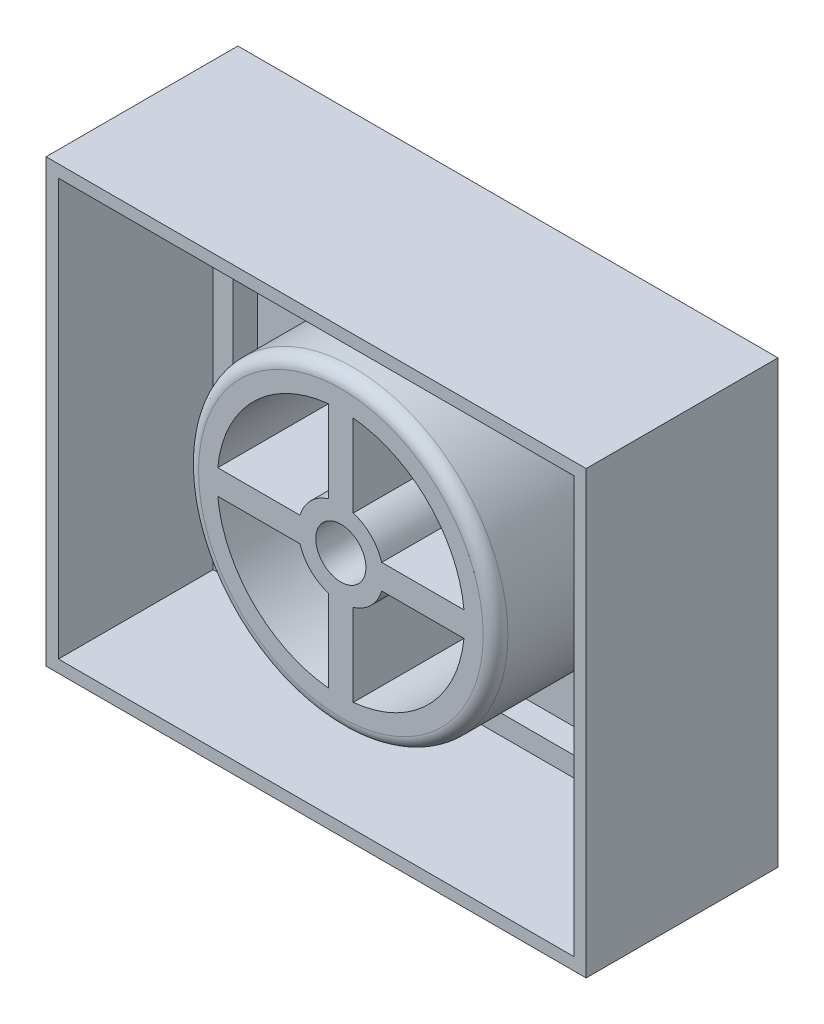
ISO-10303-21;
HEADER;
FILE_DESCRIPTION(('STEP AP214'),'2;1');
FILE_NAME('part.step','',(''),(''),'','','');
FILE_SCHEMA(('AUTOMOTIVE_DESIGN { 1 0 10303 214 1 1 1 1 }'));
ENDSEC;
DATA;
#1=APPLICATION_CONTEXT('core data for automotive mechanical design processes');
#2=APPLICATION_PROTOCOL_DEFINITION('international standard','automotive_design',2000,#1);
#3=PRODUCT_CONTEXT('',#1,'mechanical');
#4=PRODUCT('Part','Part','',(#3));
#5=PRODUCT_RELATED_PRODUCT_CATEGORY('part','',(#4));
#6=PRODUCT_DEFINITION_FORMATION('','',#4);
#7=PRODUCT_DEFINITION_CONTEXT('part definition',#1,'design');
#8=PRODUCT_DEFINITION('design','',#6,#7);
#9=PRODUCT_DEFINITION_SHAPE('','',#8);
#10=(LENGTH_UNIT() NAMED_UNIT(*) SI_UNIT(.MILLI.,.METRE.));
#11=(NAMED_UNIT(*) PLANE_ANGLE_UNIT() SI_UNIT($,.RADIAN.));
#12=(NAMED_UNIT(*) SI_UNIT($,.STERADIAN.) SOLID_ANGLE_UNIT());
#13=UNCERTAINTY_MEASURE_WITH_UNIT(LENGTH_MEASURE(1.E-05),#10,'distance_accuracy_value','');
#14=(GEOMETRIC_REPRESENTATION_CONTEXT(3) GLOBAL_UNCERTAINTY_ASSIGNED_CONTEXT((#13)) GLOBAL_UNIT_ASSIGNED_CONTEXT((#10,
#11,#12)) REPRESENTATION_CONTEXT('',''));
#15=CARTESIAN_POINT('',(0.,0.,0.));
#16=DIRECTION('',(0.,0.,1.));
#17=DIRECTION('',(1.,0.,0.));
#18=AXIS2_PLACEMENT_3D('',#15,#16,#17);
#19=CARTESIAN_POINT('',(0.,0.,0.));
#20=DIRECTION('',(0.,0.,1.));
#21=DIRECTION('',(1.,0.,0.));
#22=AXIS2_PLACEMENT_3D('',#19,#20,#21);
#23=PLANE('',#22);
#24=DIRECTION('',(0.,-1.,0.));
#25=VECTOR('',#24,1.);
#26=CARTESIAN_POINT('',(-48.6339371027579,35.6684077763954,0.));
#27=LINE('',#26,#25);
#28=CARTESIAN_POINT('',(-48.6339371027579,35.6684077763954,0.));
#29=VERTEX_POINT('',#28);
#30=CARTESIAN_POINT('',(-48.6339371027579,-25.2367500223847,0.));
#31=VERTEX_POINT('',#30);
#32=EDGE_CURVE('E76',#29,#31,#27,.T.);
#33=ORIENTED_EDGE('',*,*,#32,.T.);
#34=DIRECTION('',(1.,0.,0.));
#35=VECTOR('',#34,1.);
#36=CARTESIAN_POINT('',(-48.6339371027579,-25.2367500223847,0.));
#37=LINE('',#36,#35);
#38=CARTESIAN_POINT('',(28.2619337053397,-25.2367500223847,0.));
#39=VERTEX_POINT('',#38);
#40=EDGE_CURVE('E80',#31,#39,#37,.T.);
#41=ORIENTED_EDGE('',*,*,#40,.T.);
#42=DIRECTION('',(0.,1.,0.));
#43=VECTOR('',#42,1.);
#44=CARTESIAN_POINT('',(28.2619337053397,-25.2367500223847,0.));
#45=LINE('',#44,#43);
#46=CARTESIAN_POINT('',(28.2619337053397,35.6684077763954,0.));
#47=VERTEX_POINT('',#46);
#48=EDGE_CURVE('E274',#39,#47,#45,.T.);
#49=ORIENTED_EDGE('',*,*,#48,.T.);
#50=DIRECTION('',(-1.,0.,0.));
#51=VECTOR('',#50,1.);
#52=CARTESIAN_POINT('',(28.2619337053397,35.6684077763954,0.));
#53=LINE('',#52,#51);
#54=EDGE_CURVE('E255',#47,#29,#53,.T.);
#55=ORIENTED_EDGE('',*,*,#54,.T.);
#56=EDGE_LOOP('',(#33,#41,#49,#55));
#57=FACE_BOUND('',#56,.T.);
#58=CARTESIAN_POINT('',(-10.1860016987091,5.21582887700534,0.));
#59=DIRECTION('',(0.,0.,1.));
#60=DIRECTION('',(1.,0.,0.));
#61=AXIS2_PLACEMENT_3D('',#58,#59,#60);
#62=CIRCLE('',#61,25.);
#63=CARTESIAN_POINT('',(14.8139983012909,5.21582887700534,0.));
#64=VERTEX_POINT('',#63);
#65=EDGE_CURVE('E342',#64,#64,#62,.T.);
#66=ORIENTED_EDGE('',*,*,#65,.F.);
#67=EDGE_LOOP('',(#66));
#68=FACE_BOUND('',#67,.T.);
#69=ADVANCED_FACE('F61',(#57,#68),#23,.T.);
#70=CARTESIAN_POINT('',(-10.1860016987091,5.21582887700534,25.));
#71=DIRECTION('',(0.,0.,1.));
#72=DIRECTION('',(1.,0.,0.));
#73=AXIS2_PLACEMENT_3D('',#70,#71,#72);
#74=PLANE('',#73);
#75=CARTESIAN_POINT('',(-10.1860016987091,5.21582887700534,25.));
#76=DIRECTION('',(0.,0.,1.));
#77=DIRECTION('',(1.,0.,0.));
#78=AXIS2_PLACEMENT_3D('',#75,#76,#77);
#79=CIRCLE('',#78,23.);
#80=CARTESIAN_POINT('',(12.8139983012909,5.21582887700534,25.));
#81=VERTEX_POINT('',#80);
#82=EDGE_CURVE('E69',#81,#81,#79,.T.);
#83=ORIENTED_EDGE('',*,*,#82,.T.);
#84=EDGE_LOOP('',(#83));
#85=FACE_BOUND('',#84,.T.);
#86=CARTESIAN_POINT('',(-10.1860016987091,5.21582887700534,25.));
#87=DIRECTION('',(0.,0.,1.));
#88=DIRECTION('',(1.,0.,0.));
#89=AXIS2_PLACEMENT_3D('',#86,#87,#88);
#90=CIRCLE('',#89,4.05);
#91=CARTESIAN_POINT('',(-6.13600169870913,5.21582887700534,25.));
#92=VERTEX_POINT('',#91);
#93=EDGE_CURVE('E464',#92,#92,#90,.T.);
#94=ORIENTED_EDGE('',*,*,#93,.F.);
#95=EDGE_LOOP('',(#94));
#96=FACE_BOUND('',#95,.T.);
#97=DIRECTION('',(1.,0.,0.));
#98=VECTOR('',#97,1.);
#99=CARTESIAN_POINT('',(-3.5822149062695,7.21582887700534,25.));
#100=LINE('',#99,#98);
#101=CARTESIAN_POINT('',(-3.5822149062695,7.21582887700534,25.));
#102=VERTEX_POINT('',#101);
#103=CARTESIAN_POINT('',(9.71374704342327,7.21582887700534,25.));
#104=VERTEX_POINT('',#103);
#105=EDGE_CURVE('E436',#102,#104,#100,.T.);
#106=ORIENTED_EDGE('',*,*,#105,.F.);
#107=CARTESIAN_POINT('',(-10.1860016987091,5.21582887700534,25.));
#108=DIRECTION('',(0.,0.,-1.));
#109=DIRECTION('',(1.,0.,0.));
#110=AXIS2_PLACEMENT_3D('',#107,#108,#109);
#111=CIRCLE('',#110,6.9);
#112=CARTESIAN_POINT('',(-8.18600169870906,11.8196156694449,25.));
#113=VERTEX_POINT('',#112);
#114=EDGE_CURVE('E434',#113,#102,#111,.T.);
#115=ORIENTED_EDGE('',*,*,#114,.F.);
#116=DIRECTION('',(0.,-1.,0.));
#117=VECTOR('',#116,1.);
#118=CARTESIAN_POINT('',(-8.18600169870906,11.8196156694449,25.));
#119=LINE('',#118,#117);
#120=CARTESIAN_POINT('',(-8.18600169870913,25.1155776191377,25.));
#121=VERTEX_POINT('',#120);
#122=EDGE_CURVE('E442',#121,#113,#119,.T.);
#123=ORIENTED_EDGE('',*,*,#122,.F.);
#124=CARTESIAN_POINT('',(-10.1860016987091,5.21582887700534,25.));
#125=DIRECTION('',(0.,0.,1.));
#126=DIRECTION('',(1.,0.,0.));
#127=AXIS2_PLACEMENT_3D('',#124,#125,#126);
#128=CIRCLE('',#127,20.);
#129=EDGE_CURVE('E439',#104,#121,#128,.T.);
#130=ORIENTED_EDGE('',*,*,#129,.F.);
#131=EDGE_LOOP('',(#106,#115,#123,#130));
#132=FACE_BOUND('',#131,.T.);
#133=DIRECTION('',(0.,-1.,0.));
#134=VECTOR('',#133,1.);
#135=CARTESIAN_POINT('',(-8.18600169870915,-1.38795791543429,25.));
#136=LINE('',#135,#134);
#137=CARTESIAN_POINT('',(-8.18600169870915,-1.38795791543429,25.));
#138=VERTEX_POINT('',#137);
#139=CARTESIAN_POINT('',(-8.18600169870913,-14.6839198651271,25.));
#140=VERTEX_POINT('',#139);
#141=EDGE_CURVE('E406',#138,#140,#136,.T.);
#142=ORIENTED_EDGE('',*,*,#141,.F.);
#143=CARTESIAN_POINT('',(-10.1860016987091,5.21582887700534,25.));
#144=DIRECTION('',(0.,0.,-1.));
#145=DIRECTION('',(1.,0.,0.));
#146=AXIS2_PLACEMENT_3D('',#143,#144,#145);
#147=CIRCLE('',#146,6.9);
#148=CARTESIAN_POINT('',(-3.5822149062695,3.21582887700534,25.));
#149=VERTEX_POINT('',#148);
#150=EDGE_CURVE('E404',#149,#138,#147,.T.);
#151=ORIENTED_EDGE('',*,*,#150,.F.);
#152=DIRECTION('',(-1.,0.,0.));
#153=VECTOR('',#152,1.);
#154=CARTESIAN_POINT('',(-3.5822149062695,3.21582887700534,25.));
#155=LINE('',#154,#153);
#156=CARTESIAN_POINT('',(9.71374704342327,3.21582887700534,25.));
#157=VERTEX_POINT('',#156);
#158=EDGE_CURVE('E412',#157,#149,#155,.T.);
#159=ORIENTED_EDGE('',*,*,#158,.F.);
#160=CARTESIAN_POINT('',(-10.1860016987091,5.21582887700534,25.));
#161=DIRECTION('',(0.,0.,1.));
#162=DIRECTION('',(1.,0.,0.));
#163=AXIS2_PLACEMENT_3D('',#160,#161,#162);
#164=CIRCLE('',#163,20.);
#165=EDGE_CURVE('E409',#140,#157,#164,.T.);
#166=ORIENTED_EDGE('',*,*,#165,.F.);
#167=EDGE_LOOP('',(#142,#151,#159,#166));
#168=FACE_BOUND('',#167,.T.);
#169=DIRECTION('',(-1.,0.,0.));
#170=VECTOR('',#169,1.);
#171=CARTESIAN_POINT('',(-16.7897884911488,3.21582887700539,25.));
#172=LINE('',#171,#170);
#173=CARTESIAN_POINT('',(-16.7897884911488,3.21582887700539,25.));
#174=VERTEX_POINT('',#173);
#175=CARTESIAN_POINT('',(-30.0857504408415,3.21582887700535,25.));
#176=VERTEX_POINT('',#175);
#177=EDGE_CURVE('E376',#174,#176,#172,.T.);
#178=ORIENTED_EDGE('',*,*,#177,.F.);
#179=CARTESIAN_POINT('',(-10.1860016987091,5.21582887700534,25.));
#180=DIRECTION('',(0.,0.,-1.));
#181=DIRECTION('',(1.,0.,0.));
#182=AXIS2_PLACEMENT_3D('',#179,#180,#181);
#183=CIRCLE('',#182,6.9);
#184=CARTESIAN_POINT('',(-12.1860016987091,-1.38795791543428,25.));
#185=VERTEX_POINT('',#184);
#186=EDGE_CURVE('E374',#185,#174,#183,.T.);
#187=ORIENTED_EDGE('',*,*,#186,.F.);
#188=DIRECTION('',(0.,1.,0.));
#189=VECTOR('',#188,1.);
#190=CARTESIAN_POINT('',(-12.1860016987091,-1.38795791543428,25.));
#191=LINE('',#190,#189);
#192=CARTESIAN_POINT('',(-12.1860016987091,-14.6839198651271,25.));
#193=VERTEX_POINT('',#192);
#194=EDGE_CURVE('E382',#193,#185,#191,.T.);
#195=ORIENTED_EDGE('',*,*,#194,.F.);
#196=CARTESIAN_POINT('',(-10.1860016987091,5.21582887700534,25.));
#197=DIRECTION('',(0.,0.,1.));
#198=DIRECTION('',(1.,0.,0.));
#199=AXIS2_PLACEMENT_3D('',#196,#197,#198);
#200=CIRCLE('',#199,20.);
#201=EDGE_CURVE('E379',#176,#193,#200,.T.);
#202=ORIENTED_EDGE('',*,*,#201,.F.);
#203=EDGE_LOOP('',(#178,#187,#195,#202));
#204=FACE_BOUND('',#203,.T.);
#205=DIRECTION('',(0.,1.,0.));
#206=VECTOR('',#205,1.);
#207=CARTESIAN_POINT('',(-12.1860016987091,11.819615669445,25.));
#208=LINE('',#207,#206);
#209=CARTESIAN_POINT('',(-12.1860016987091,11.819615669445,25.));
#210=VERTEX_POINT('',#209);
#211=CARTESIAN_POINT('',(-12.1860016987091,25.1155776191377,25.));
#212=VERTEX_POINT('',#211);
#213=EDGE_CURVE('E345',#210,#212,#208,.T.);
#214=ORIENTED_EDGE('',*,*,#213,.F.);
#215=CARTESIAN_POINT('',(-10.1860016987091,5.21582887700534,25.));
#216=DIRECTION('',(0.,0.,-1.));
#217=DIRECTION('',(1.,0.,0.));
#218=AXIS2_PLACEMENT_3D('',#215,#216,#217);
#219=CIRCLE('',#218,6.9);
#220=CARTESIAN_POINT('',(-16.7897884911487,7.21582887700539,25.));
#221=VERTEX_POINT('',#220);
#222=EDGE_CURVE('E343',#221,#210,#219,.T.);
#223=ORIENTED_EDGE('',*,*,#222,.F.);
#224=DIRECTION('',(1.,0.,0.));
#225=VECTOR('',#224,1.);
#226=CARTESIAN_POINT('',(-16.7897884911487,7.21582887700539,25.));
#227=LINE('',#226,#225);
#228=CARTESIAN_POINT('',(-30.0857504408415,7.21582887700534,25.));
#229=VERTEX_POINT('',#228);
#230=EDGE_CURVE('E351',#229,#221,#227,.T.);
#231=ORIENTED_EDGE('',*,*,#230,.F.);
#232=CARTESIAN_POINT('',(-10.1860016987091,5.21582887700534,25.));
#233=DIRECTION('',(0.,0.,1.));
#234=DIRECTION('',(1.,0.,0.));
#235=AXIS2_PLACEMENT_3D('',#232,#233,#234);
#236=CIRCLE('',#235,20.);
#237=EDGE_CURVE('E348',#212,#229,#236,.T.);
#238=ORIENTED_EDGE('',*,*,#237,.F.);
#239=EDGE_LOOP('',(#214,#223,#231,#238));
#240=FACE_BOUND('',#239,.T.);
#241=ADVANCED_FACE('F473',(#85,#96,#132,#168,#204,#240),#74,.T.);
#242=CARTESIAN_POINT('',(-10.1860016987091,5.21582887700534,25.));
#243=DIRECTION('',(0.,0.,-1.));
#244=DIRECTION('',(-1.,0.,0.));
#245=AXIS2_PLACEMENT_3D('',#242,#243,#244);
#246=CYLINDRICAL_SURFACE('',#245,25.);
#247=CARTESIAN_POINT('',(-10.1860016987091,5.21582887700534,23.));
#248=DIRECTION('',(0.,0.,1.));
#249=DIRECTION('',(1.,0.,0.));
#250=AXIS2_PLACEMENT_3D('',#247,#248,#249);
#251=CIRCLE('',#250,25.);
#252=CARTESIAN_POINT('',(14.8139983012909,5.21582887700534,23.));
#253=VERTEX_POINT('',#252);
#254=EDGE_CURVE('E12',#253,#253,#251,.F.);
#255=ORIENTED_EDGE('',*,*,#254,.T.);
#256=EDGE_LOOP('',(#255));
#257=FACE_BOUND('',#256,.T.);
#258=ORIENTED_EDGE('',*,*,#65,.T.);
#259=EDGE_LOOP('',(#258));
#260=FACE_BOUND('',#259,.T.);
#261=ADVANCED_FACE('F493',(#257,#260),#246,.T.);
#262=CARTESIAN_POINT('',(-10.1860016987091,5.21582887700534,25.));
#263=DIRECTION('',(0.,0.,-1.));
#264=DIRECTION('',(-1.,0.,0.));
#265=AXIS2_PLACEMENT_3D('',#262,#263,#264);
#266=CYLINDRICAL_SURFACE('',#265,4.05);
#267=ORIENTED_EDGE('',*,*,#93,.T.);
#268=EDGE_LOOP('',(#267));
#269=FACE_BOUND('',#268,.T.);
#270=CARTESIAN_POINT('',(-10.1860016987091,5.21582887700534,0.));
#271=DIRECTION('',(0.,0.,1.));
#272=DIRECTION('',(1.,0.,0.));
#273=AXIS2_PLACEMENT_3D('',#270,#271,#272);
#274=CIRCLE('',#273,4.05);
#275=CARTESIAN_POINT('',(-6.13600169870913,5.21582887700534,0.));
#276=VERTEX_POINT('',#275);
#277=EDGE_CURVE('E463',#276,#276,#274,.T.);
#278=ORIENTED_EDGE('',*,*,#277,.F.);
#279=EDGE_LOOP('',(#278));
#280=FACE_BOUND('',#279,.T.);
#281=ADVANCED_FACE('F587',(#269,#280),#266,.F.);
#282=CARTESIAN_POINT('',(-10.1860016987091,5.21582887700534,25.));
#283=DIRECTION('',(0.,0.,-1.));
#284=DIRECTION('',(-1.,0.,0.));
#285=AXIS2_PLACEMENT_3D('',#282,#283,#284);
#286=CYLINDRICAL_SURFACE('',#285,6.9);
#287=CARTESIAN_POINT('',(-10.1860016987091,5.21582887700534,0.));
#288=DIRECTION('',(0.,0.,-1.));
#289=DIRECTION('',(1.,0.,0.));
#290=AXIS2_PLACEMENT_3D('',#287,#288,#289);
#291=CIRCLE('',#290,6.9);
#292=CARTESIAN_POINT('',(-8.18600169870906,11.8196156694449,0.));
#293=VERTEX_POINT('',#292);
#294=CARTESIAN_POINT('',(-3.5822149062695,7.21582887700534,0.));
#295=VERTEX_POINT('',#294);
#296=EDGE_CURVE('E433',#293,#295,#291,.T.);
#297=ORIENTED_EDGE('',*,*,#296,.F.);
#298=DIRECTION('',(0.,0.,-1.));
#299=VECTOR('',#298,1.);
#300=CARTESIAN_POINT('',(-8.18600169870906,11.8196156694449,25.));
#301=LINE('',#300,#299);
#302=EDGE_CURVE('E444',#113,#293,#301,.T.);
#303=ORIENTED_EDGE('',*,*,#302,.F.);
#304=ORIENTED_EDGE('',*,*,#114,.T.);
#305=DIRECTION('',(0.,0.,-1.));
#306=VECTOR('',#305,1.);
#307=CARTESIAN_POINT('',(-3.5822149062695,7.21582887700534,25.));
#308=LINE('',#307,#306);
#309=EDGE_CURVE('E460',#102,#295,#308,.T.);
#310=ORIENTED_EDGE('',*,*,#309,.T.);
#311=EDGE_LOOP('',(#297,#303,#304,#310));
#312=FACE_BOUND('',#311,.T.);
#313=ADVANCED_FACE('F583',(#312),#286,.T.);
#314=CARTESIAN_POINT('',(-3.5822149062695,7.21582887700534,25.));
#315=DIRECTION('',(0.,1.,0.));
#316=DIRECTION('',(0.,0.,1.));
#317=AXIS2_PLACEMENT_3D('',#314,#315,#316);
#318=PLANE('',#317);
#319=DIRECTION('',(1.,0.,0.));
#320=VECTOR('',#319,1.);
#321=CARTESIAN_POINT('',(-3.5822149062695,7.21582887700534,0.));
#322=LINE('',#321,#320);
#323=CARTESIAN_POINT('',(9.71374704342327,7.21582887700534,0.));
#324=VERTEX_POINT('',#323);
#325=EDGE_CURVE('E447',#295,#324,#322,.T.);
#326=ORIENTED_EDGE('',*,*,#325,.F.);
#327=ORIENTED_EDGE('',*,*,#309,.F.);
#328=ORIENTED_EDGE('',*,*,#105,.T.);
#329=DIRECTION('',(0.,0.,-1.));
#330=VECTOR('',#329,1.);
#331=CARTESIAN_POINT('',(9.71374704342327,7.21582887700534,25.));
#332=LINE('',#331,#330);
#333=EDGE_CURVE('E458',#104,#324,#332,.T.);
#334=ORIENTED_EDGE('',*,*,#333,.T.);
#335=EDGE_LOOP('',(#326,#327,#328,#334));
#336=FACE_BOUND('',#335,.T.);
#337=ADVANCED_FACE('F579',(#336),#318,.T.);
#338=CARTESIAN_POINT('',(-10.1860016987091,5.21582887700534,25.));
#339=DIRECTION('',(0.,0.,-1.));
#340=DIRECTION('',(-1.,0.,0.));
#341=AXIS2_PLACEMENT_3D('',#338,#339,#340);
#342=CYLINDRICAL_SURFACE('',#341,20.);
#343=CARTESIAN_POINT('',(-10.1860016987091,5.21582887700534,0.));
#344=DIRECTION('',(0.,0.,1.));
#345=DIRECTION('',(1.,0.,0.));
#346=AXIS2_PLACEMENT_3D('',#343,#344,#345);
#347=CIRCLE('',#346,20.);
#348=CARTESIAN_POINT('',(-8.18600169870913,25.1155776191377,0.));
#349=VERTEX_POINT('',#348);
#350=EDGE_CURVE('E450',#324,#349,#347,.T.);
#351=ORIENTED_EDGE('',*,*,#350,.F.);
#352=ORIENTED_EDGE('',*,*,#333,.F.);
#353=ORIENTED_EDGE('',*,*,#129,.T.);
#354=DIRECTION('',(0.,0.,-1.));
#355=VECTOR('',#354,1.);
#356=CARTESIAN_POINT('',(-8.18600169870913,25.1155776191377,25.));
#357=LINE('',#356,#355);
#358=EDGE_CURVE('E456',#121,#349,#357,.T.);
#359=ORIENTED_EDGE('',*,*,#358,.T.);
#360=EDGE_LOOP('',(#351,#352,#353,#359));
#361=FACE_BOUND('',#360,.T.);
#362=ADVANCED_FACE('F575',(#361),#342,.F.);
#363=CARTESIAN_POINT('',(-8.18600169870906,11.8196156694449,25.));
#364=DIRECTION('',(1.,0.,0.));
#365=DIRECTION('',(0.,1.,0.));
#366=AXIS2_PLACEMENT_3D('',#363,#364,#365);
#367=PLANE('',#366);
#368=DIRECTION('',(0.,-1.,0.));
#369=VECTOR('',#368,1.);
#370=CARTESIAN_POINT('',(-8.18600169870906,11.8196156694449,0.));
#371=LINE('',#370,#369);
#372=EDGE_CURVE('E437',#349,#293,#371,.T.);
#373=ORIENTED_EDGE('',*,*,#372,.F.);
#374=ORIENTED_EDGE('',*,*,#358,.F.);
#375=ORIENTED_EDGE('',*,*,#122,.T.);
#376=ORIENTED_EDGE('',*,*,#302,.T.);
#377=EDGE_LOOP('',(#373,#374,#375,#376));
#378=FACE_BOUND('',#377,.T.);
#379=ADVANCED_FACE('F571',(#378),#367,.T.);
#380=CARTESIAN_POINT('',(-10.1860016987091,5.21582887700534,25.));
#381=DIRECTION('',(0.,0.,-1.));
#382=DIRECTION('',(-1.,0.,0.));
#383=AXIS2_PLACEMENT_3D('',#380,#381,#382);
#384=CYLINDRICAL_SURFACE('',#383,6.9);
#385=CARTESIAN_POINT('',(-10.1860016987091,5.21582887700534,0.));
#386=DIRECTION('',(0.,0.,-1.));
#387=DIRECTION('',(1.,0.,0.));
#388=AXIS2_PLACEMENT_3D('',#385,#386,#387);
#389=CIRCLE('',#388,6.9);
#390=CARTESIAN_POINT('',(-3.5822149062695,3.21582887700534,0.));
#391=VERTEX_POINT('',#390);
#392=CARTESIAN_POINT('',(-8.18600169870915,-1.38795791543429,0.));
#393=VERTEX_POINT('',#392);
#394=EDGE_CURVE('E403',#391,#393,#389,.T.);
#395=ORIENTED_EDGE('',*,*,#394,.F.);
#396=DIRECTION('',(0.,0.,-1.));
#397=VECTOR('',#396,1.);
#398=CARTESIAN_POINT('',(-3.5822149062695,3.21582887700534,25.));
#399=LINE('',#398,#397);
#400=EDGE_CURVE('E414',#149,#391,#399,.T.);
#401=ORIENTED_EDGE('',*,*,#400,.F.);
#402=ORIENTED_EDGE('',*,*,#150,.T.);
#403=DIRECTION('',(0.,0.,-1.));
#404=VECTOR('',#403,1.);
#405=CARTESIAN_POINT('',(-8.18600169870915,-1.38795791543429,25.));
#406=LINE('',#405,#404);
#407=EDGE_CURVE('E430',#138,#393,#406,.T.);
#408=ORIENTED_EDGE('',*,*,#407,.T.);
#409=EDGE_LOOP('',(#395,#401,#402,#408));
#410=FACE_BOUND('',#409,.T.);
#411=ADVANCED_FACE('F567',(#410),#384,.T.);
#412=CARTESIAN_POINT('',(-8.18600169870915,-1.38795791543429,25.));
#413=DIRECTION('',(1.,0.,0.));
#414=DIRECTION('',(0.,1.,0.));
#415=AXIS2_PLACEMENT_3D('',#412,#413,#414);
#416=PLANE('',#415);
#417=DIRECTION('',(0.,-1.,0.));
#418=VECTOR('',#417,1.);
#419=CARTESIAN_POINT('',(-8.18600169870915,-1.38795791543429,0.));
#420=LINE('',#419,#418);
#421=CARTESIAN_POINT('',(-8.18600169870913,-14.6839198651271,0.));
#422=VERTEX_POINT('',#421);
#423=EDGE_CURVE('E417',#393,#422,#420,.T.);
#424=ORIENTED_EDGE('',*,*,#423,.F.);
#425=ORIENTED_EDGE('',*,*,#407,.F.);
#426=ORIENTED_EDGE('',*,*,#141,.T.);
#427=DIRECTION('',(0.,0.,-1.));
#428=VECTOR('',#427,1.);
#429=CARTESIAN_POINT('',(-8.18600169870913,-14.6839198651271,25.));
#430=LINE('',#429,#428);
#431=EDGE_CURVE('E428',#140,#422,#430,.T.);
#432=ORIENTED_EDGE('',*,*,#431,.T.);
#433=EDGE_LOOP('',(#424,#425,#426,#432));
#434=FACE_BOUND('',#433,.T.);
#435=ADVANCED_FACE('F563',(#434),#416,.T.);
#436=CARTESIAN_POINT('',(-10.1860016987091,5.21582887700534,25.));
#437=DIRECTION('',(0.,0.,-1.));
#438=DIRECTION('',(-1.,0.,0.));
#439=AXIS2_PLACEMENT_3D('',#436,#437,#438);
#440=CYLINDRICAL_SURFACE('',#439,20.);
#441=CARTESIAN_POINT('',(-10.1860016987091,5.21582887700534,0.));
#442=DIRECTION('',(0.,0.,1.));
#443=DIRECTION('',(1.,0.,0.));
#444=AXIS2_PLACEMENT_3D('',#441,#442,#443);
#445=CIRCLE('',#444,20.);
#446=CARTESIAN_POINT('',(9.71374704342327,3.21582887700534,0.));
#447=VERTEX_POINT('',#446);
#448=EDGE_CURVE('E420',#422,#447,#445,.T.);
#449=ORIENTED_EDGE('',*,*,#448,.F.);
#450=ORIENTED_EDGE('',*,*,#431,.F.);
#451=ORIENTED_EDGE('',*,*,#165,.T.);
#452=DIRECTION('',(0.,0.,-1.));
#453=VECTOR('',#452,1.);
#454=CARTESIAN_POINT('',(9.71374704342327,3.21582887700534,25.));
#455=LINE('',#454,#453);
#456=EDGE_CURVE('E426',#157,#447,#455,.T.);
#457=ORIENTED_EDGE('',*,*,#456,.T.);
#458=EDGE_LOOP('',(#449,#450,#451,#457));
#459=FACE_BOUND('',#458,.T.);
#460=ADVANCED_FACE('F559',(#459),#440,.F.);
#461=CARTESIAN_POINT('',(-3.5822149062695,3.21582887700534,25.));
#462=DIRECTION('',(0.,-1.,0.));
#463=DIRECTION('',(0.,0.,-1.));
#464=AXIS2_PLACEMENT_3D('',#461,#462,#463);
#465=PLANE('',#464);
#466=DIRECTION('',(-1.,0.,0.));
#467=VECTOR('',#466,1.);
#468=CARTESIAN_POINT('',(-3.5822149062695,3.21582887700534,0.));
#469=LINE('',#468,#467);
#470=EDGE_CURVE('E407',#447,#391,#469,.T.);
#471=ORIENTED_EDGE('',*,*,#470,.F.);
#472=ORIENTED_EDGE('',*,*,#456,.F.);
#473=ORIENTED_EDGE('',*,*,#158,.T.);
#474=ORIENTED_EDGE('',*,*,#400,.T.);
#475=EDGE_LOOP('',(#471,#472,#473,#474));
#476=FACE_BOUND('',#475,.T.);
#477=ADVANCED_FACE('F555',(#476),#465,.T.);
#478=CARTESIAN_POINT('',(-10.1860016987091,5.21582887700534,25.));
#479=DIRECTION('',(0.,0.,-1.));
#480=DIRECTION('',(-1.,0.,0.));
#481=AXIS2_PLACEMENT_3D('',#478,#479,#480);
#482=CYLINDRICAL_SURFACE('',#481,6.9);
#483=CARTESIAN_POINT('',(-10.1860016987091,5.21582887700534,0.));
#484=DIRECTION('',(0.,0.,-1.));
#485=DIRECTION('',(1.,0.,0.));
#486=AXIS2_PLACEMENT_3D('',#483,#484,#485);
#487=CIRCLE('',#486,6.9);
#488=CARTESIAN_POINT('',(-12.1860016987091,-1.38795791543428,0.));
#489=VERTEX_POINT('',#488);
#490=CARTESIAN_POINT('',(-16.7897884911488,3.21582887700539,0.));
#491=VERTEX_POINT('',#490);
#492=EDGE_CURVE('E373',#489,#491,#487,.T.);
#493=ORIENTED_EDGE('',*,*,#492,.F.);
#494=DIRECTION('',(0.,0.,-1.));
#495=VECTOR('',#494,1.);
#496=CARTESIAN_POINT('',(-12.1860016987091,-1.38795791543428,25.));
#497=LINE('',#496,#495);
#498=EDGE_CURVE('E384',#185,#489,#497,.T.);
#499=ORIENTED_EDGE('',*,*,#498,.F.);
#500=ORIENTED_EDGE('',*,*,#186,.T.);
#501=DIRECTION('',(0.,0.,-1.));
#502=VECTOR('',#501,1.);
#503=CARTESIAN_POINT('',(-16.7897884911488,3.21582887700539,25.));
#504=LINE('',#503,#502);
#505=EDGE_CURVE('E400',#174,#491,#504,.T.);
#506=ORIENTED_EDGE('',*,*,#505,.T.);
#507=EDGE_LOOP('',(#493,#499,#500,#506));
#508=FACE_BOUND('',#507,.T.);
#509=ADVANCED_FACE('F551',(#508),#482,.T.);
#510=CARTESIAN_POINT('',(-16.7897884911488,3.21582887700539,25.));
#511=DIRECTION('',(0.,-1.,0.));
#512=DIRECTION('',(1.,0.,0.));
#513=AXIS2_PLACEMENT_3D('',#510,#511,#512);
#514=PLANE('',#513);
#515=DIRECTION('',(-1.,0.,0.));
#516=VECTOR('',#515,1.);
#517=CARTESIAN_POINT('',(-16.7897884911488,3.21582887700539,0.));
#518=LINE('',#517,#516);
#519=CARTESIAN_POINT('',(-30.0857504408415,3.21582887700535,0.));
#520=VERTEX_POINT('',#519);
#521=EDGE_CURVE('E387',#491,#520,#518,.T.);
#522=ORIENTED_EDGE('',*,*,#521,.F.);
#523=ORIENTED_EDGE('',*,*,#505,.F.);
#524=ORIENTED_EDGE('',*,*,#177,.T.);
#525=DIRECTION('',(0.,0.,-1.));
#526=VECTOR('',#525,1.);
#527=CARTESIAN_POINT('',(-30.0857504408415,3.21582887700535,25.));
#528=LINE('',#527,#526);
#529=EDGE_CURVE('E398',#176,#520,#528,.T.);
#530=ORIENTED_EDGE('',*,*,#529,.T.);
#531=EDGE_LOOP('',(#522,#523,#524,#530));
#532=FACE_BOUND('',#531,.T.);
#533=ADVANCED_FACE('F547',(#532),#514,.T.);
#534=CARTESIAN_POINT('',(-10.1860016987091,5.21582887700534,25.));
#535=DIRECTION('',(0.,0.,-1.));
#536=DIRECTION('',(-1.,0.,0.));
#537=AXIS2_PLACEMENT_3D('',#534,#535,#536);
#538=CYLINDRICAL_SURFACE('',#537,20.);
#539=CARTESIAN_POINT('',(-10.1860016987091,5.21582887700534,0.));
#540=DIRECTION('',(0.,0.,1.));
#541=DIRECTION('',(1.,0.,0.));
#542=AXIS2_PLACEMENT_3D('',#539,#540,#541);
#543=CIRCLE('',#542,20.);
#544=CARTESIAN_POINT('',(-12.1860016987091,-14.6839198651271,0.));
#545=VERTEX_POINT('',#544);
#546=EDGE_CURVE('E390',#520,#545,#543,.T.);
#547=ORIENTED_EDGE('',*,*,#546,.F.);
#548=ORIENTED_EDGE('',*,*,#529,.F.);
#549=ORIENTED_EDGE('',*,*,#201,.T.);
#550=DIRECTION('',(0.,0.,-1.));
#551=VECTOR('',#550,1.);
#552=CARTESIAN_POINT('',(-12.1860016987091,-14.6839198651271,25.));
#553=LINE('',#552,#551);
#554=EDGE_CURVE('E396',#193,#545,#553,.T.);
#555=ORIENTED_EDGE('',*,*,#554,.T.);
#556=EDGE_LOOP('',(#547,#548,#549,#555));
#557=FACE_BOUND('',#556,.T.);
#558=ADVANCED_FACE('F543',(#557),#538,.F.);
#559=CARTESIAN_POINT('',(-12.1860016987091,-1.38795791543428,25.));
#560=DIRECTION('',(-1.,0.,0.));
#561=DIRECTION('',(0.,-1.,0.));
#562=AXIS2_PLACEMENT_3D('',#559,#560,#561);
#563=PLANE('',#562);
#564=DIRECTION('',(0.,1.,0.));
#565=VECTOR('',#564,1.);
#566=CARTESIAN_POINT('',(-12.1860016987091,-1.38795791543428,0.));
#567=LINE('',#566,#565);
#568=EDGE_CURVE('E377',#545,#489,#567,.T.);
#569=ORIENTED_EDGE('',*,*,#568,.F.);
#570=ORIENTED_EDGE('',*,*,#554,.F.);
#571=ORIENTED_EDGE('',*,*,#194,.T.);
#572=ORIENTED_EDGE('',*,*,#498,.T.);
#573=EDGE_LOOP('',(#569,#570,#571,#572));
#574=FACE_BOUND('',#573,.T.);
#575=ADVANCED_FACE('F540',(#574),#563,.T.);
#576=CARTESIAN_POINT('',(-10.1860016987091,5.21582887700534,25.));
#577=DIRECTION('',(0.,0.,-1.));
#578=DIRECTION('',(-1.,0.,0.));
#579=AXIS2_PLACEMENT_3D('',#576,#577,#578);
#580=CYLINDRICAL_SURFACE('',#579,6.9);
#581=CARTESIAN_POINT('',(-10.1860016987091,5.21582887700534,0.));
#582=DIRECTION('',(0.,0.,-1.));
#583=DIRECTION('',(1.,0.,0.));
#584=AXIS2_PLACEMENT_3D('',#581,#582,#583);
#585=CIRCLE('',#584,6.9);
#586=CARTESIAN_POINT('',(-16.7897884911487,7.21582887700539,0.));
#587=VERTEX_POINT('',#586);
#588=CARTESIAN_POINT('',(-12.1860016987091,11.819615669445,0.));
#589=VERTEX_POINT('',#588);
#590=EDGE_CURVE('E354',#587,#589,#585,.T.);
#591=ORIENTED_EDGE('',*,*,#590,.F.);
#592=DIRECTION('',(0.,0.,-1.));
#593=VECTOR('',#592,1.);
#594=CARTESIAN_POINT('',(-16.7897884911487,7.21582887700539,25.));
#595=LINE('',#594,#593);
#596=EDGE_CURVE('E353',#221,#587,#595,.T.);
#597=ORIENTED_EDGE('',*,*,#596,.F.);
#598=ORIENTED_EDGE('',*,*,#222,.T.);
#599=DIRECTION('',(0.,0.,-1.));
#600=VECTOR('',#599,1.);
#601=CARTESIAN_POINT('',(-12.1860016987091,11.819615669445,25.));
#602=LINE('',#601,#600);
#603=EDGE_CURVE('E370',#210,#589,#602,.T.);
#604=ORIENTED_EDGE('',*,*,#603,.T.);
#605=EDGE_LOOP('',(#591,#597,#598,#604));
#606=FACE_BOUND('',#605,.T.);
#607=ADVANCED_FACE('F521',(#606),#580,.T.);
#608=CARTESIAN_POINT('',(-12.1860016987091,11.819615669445,25.));
#609=DIRECTION('',(-1.,0.,0.));
#610=DIRECTION('',(0.,-1.,0.));
#611=AXIS2_PLACEMENT_3D('',#608,#609,#610);
#612=PLANE('',#611);
#613=DIRECTION('',(0.,1.,0.));
#614=VECTOR('',#613,1.);
#615=CARTESIAN_POINT('',(-12.1860016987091,11.819615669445,0.));
#616=LINE('',#615,#614);
#617=CARTESIAN_POINT('',(-12.1860016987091,25.1155776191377,0.));
#618=VERTEX_POINT('',#617);
#619=EDGE_CURVE('E357',#589,#618,#616,.T.);
#620=ORIENTED_EDGE('',*,*,#619,.F.);
#621=ORIENTED_EDGE('',*,*,#603,.F.);
#622=ORIENTED_EDGE('',*,*,#213,.T.);
#623=DIRECTION('',(0.,0.,-1.));
#624=VECTOR('',#623,1.);
#625=CARTESIAN_POINT('',(-12.1860016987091,25.1155776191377,25.));
#626=LINE('',#625,#624);
#627=EDGE_CURVE('E368',#212,#618,#626,.T.);
#628=ORIENTED_EDGE('',*,*,#627,.T.);
#629=EDGE_LOOP('',(#620,#621,#622,#628));
#630=FACE_BOUND('',#629,.T.);
#631=ADVANCED_FACE('F525',(#630),#612,.T.);
#632=CARTESIAN_POINT('',(-10.1860016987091,5.21582887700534,25.));
#633=DIRECTION('',(0.,0.,-1.));
#634=DIRECTION('',(-1.,0.,0.));
#635=AXIS2_PLACEMENT_3D('',#632,#633,#634);
#636=CYLINDRICAL_SURFACE('',#635,20.);
#637=CARTESIAN_POINT('',(-10.1860016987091,5.21582887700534,0.));
#638=DIRECTION('',(0.,0.,1.));
#639=DIRECTION('',(1.,0.,0.));
#640=AXIS2_PLACEMENT_3D('',#637,#638,#639);
#641=CIRCLE('',#640,20.);
#642=CARTESIAN_POINT('',(-30.0857504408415,7.21582887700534,0.));
#643=VERTEX_POINT('',#642);
#644=EDGE_CURVE('E360',#618,#643,#641,.T.);
#645=ORIENTED_EDGE('',*,*,#644,.F.);
#646=ORIENTED_EDGE('',*,*,#627,.F.);
#647=ORIENTED_EDGE('',*,*,#237,.T.);
#648=DIRECTION('',(0.,0.,-1.));
#649=VECTOR('',#648,1.);
#650=CARTESIAN_POINT('',(-30.0857504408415,7.21582887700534,25.));
#651=LINE('',#650,#649);
#652=EDGE_CURVE('E366',#229,#643,#651,.T.);
#653=ORIENTED_EDGE('',*,*,#652,.T.);
#654=EDGE_LOOP('',(#645,#646,#647,#653));
#655=FACE_BOUND('',#654,.T.);
#656=ADVANCED_FACE('F511',(#655),#636,.F.);
#657=CARTESIAN_POINT('',(-16.7897884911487,7.21582887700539,25.));
#658=DIRECTION('',(0.,1.,0.));
#659=DIRECTION('',(-1.,0.,0.));
#660=AXIS2_PLACEMENT_3D('',#657,#658,#659);
#661=PLANE('',#660);
#662=DIRECTION('',(1.,0.,0.));
#663=VECTOR('',#662,1.);
#664=CARTESIAN_POINT('',(-16.7897884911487,7.21582887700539,0.));
#665=LINE('',#664,#663);
#666=EDGE_CURVE('E346',#643,#587,#665,.T.);
#667=ORIENTED_EDGE('',*,*,#666,.F.);
#668=ORIENTED_EDGE('',*,*,#652,.F.);
#669=ORIENTED_EDGE('',*,*,#230,.T.);
#670=ORIENTED_EDGE('',*,*,#596,.T.);
#671=EDGE_LOOP('',(#667,#668,#669,#670));
#672=FACE_BOUND('',#671,.T.);
#673=ADVANCED_FACE('F503',(#672),#661,.T.);
#674=ORIENTED_EDGE('',*,*,#666,.T.);
#675=ORIENTED_EDGE('',*,*,#590,.T.);
#676=ORIENTED_EDGE('',*,*,#619,.T.);
#677=ORIENTED_EDGE('',*,*,#644,.T.);
#678=EDGE_LOOP('',(#674,#675,#676,#677));
#679=FACE_BOUND('',#678,.T.);
#680=ADVANCED_FACE('F489',(#679),#23,.T.);
#681=ORIENTED_EDGE('',*,*,#470,.T.);
#682=ORIENTED_EDGE('',*,*,#394,.T.);
#683=ORIENTED_EDGE('',*,*,#423,.T.);
#684=ORIENTED_EDGE('',*,*,#448,.T.);
#685=EDGE_LOOP('',(#681,#682,#683,#684));
#686=FACE_BOUND('',#685,.T.);
#687=ADVANCED_FACE('F502',(#686),#23,.T.);
#688=ORIENTED_EDGE('',*,*,#277,.T.);
#689=EDGE_LOOP('',(#688));
#690=FACE_BOUND('',#689,.T.);
#691=ADVANCED_FACE('F509',(#690),#23,.T.);
#692=ORIENTED_EDGE('',*,*,#372,.T.);
#693=ORIENTED_EDGE('',*,*,#296,.T.);
#694=ORIENTED_EDGE('',*,*,#325,.T.);
#695=ORIENTED_EDGE('',*,*,#350,.T.);
#696=EDGE_LOOP('',(#692,#693,#694,#695));
#697=FACE_BOUND('',#696,.T.);
#698=ADVANCED_FACE('F499',(#697),#23,.T.);
#699=ORIENTED_EDGE('',*,*,#568,.T.);
#700=ORIENTED_EDGE('',*,*,#492,.T.);
#701=ORIENTED_EDGE('',*,*,#521,.T.);
#702=ORIENTED_EDGE('',*,*,#546,.T.);
#703=EDGE_LOOP('',(#699,#700,#701,#702));
#704=FACE_BOUND('',#703,.T.);
#705=ADVANCED_FACE('F488',(#704),#23,.T.);
#706=CARTESIAN_POINT('',(0.,0.,4.));
#707=DIRECTION('',(0.,0.,1.));
#708=DIRECTION('',(1.,0.,0.));
#709=AXIS2_PLACEMENT_3D('',#706,#707,#708);
#710=PLANE('',#709);
#711=DIRECTION('',(0.,1.,0.));
#712=VECTOR('',#711,1.);
#713=CARTESIAN_POINT('',(31.4619337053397,-28.4367500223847,4.));
#714=LINE('',#713,#712);
#715=CARTESIAN_POINT('',(31.4619337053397,-28.4367500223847,4.));
#716=VERTEX_POINT('',#715);
#717=CARTESIAN_POINT('',(31.4619337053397,38.8684077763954,4.));
#718=VERTEX_POINT('',#717);
#719=EDGE_CURVE('E260',#716,#718,#714,.T.);
#720=ORIENTED_EDGE('',*,*,#719,.T.);
#721=DIRECTION('',(-1.,0.,0.));
#722=VECTOR('',#721,1.);
#723=CARTESIAN_POINT('',(31.4619337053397,38.8684077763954,4.));
#724=LINE('',#723,#722);
#725=CARTESIAN_POINT('',(-51.8339371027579,38.8684077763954,4.00000000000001));
#726=VERTEX_POINT('',#725);
#727=EDGE_CURVE('E283',#718,#726,#724,.T.);
#728=ORIENTED_EDGE('',*,*,#727,.T.);
#729=DIRECTION('',(0.,-1.,0.));
#730=VECTOR('',#729,1.);
#731=CARTESIAN_POINT('',(-51.8339371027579,38.8684077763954,4.));
#732=LINE('',#731,#730);
#733=CARTESIAN_POINT('',(-51.8339371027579,-28.4367500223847,4.));
#734=VERTEX_POINT('',#733);
#735=EDGE_CURVE('E285',#726,#734,#732,.T.);
#736=ORIENTED_EDGE('',*,*,#735,.T.);
#737=DIRECTION('',(1.,0.,0.));
#738=VECTOR('',#737,1.);
#739=CARTESIAN_POINT('',(-51.8339371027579,-28.4367500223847,4.));
#740=LINE('',#739,#738);
#741=EDGE_CURVE('E287',#734,#716,#740,.T.);
#742=ORIENTED_EDGE('',*,*,#741,.T.);
#743=EDGE_LOOP('',(#720,#728,#736,#742));
#744=FACE_BOUND('',#743,.T.);
#745=DIRECTION('',(1.,0.,0.));
#746=VECTOR('',#745,1.);
#747=CARTESIAN_POINT('',(-48.6339371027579,-25.2367500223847,4.));
#748=LINE('',#747,#746);
#749=CARTESIAN_POINT('',(-48.6339371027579,-25.2367500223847,4.));
#750=VERTEX_POINT('',#749);
#751=CARTESIAN_POINT('',(28.2619337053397,-25.2367500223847,4.));
#752=VERTEX_POINT('',#751);
#753=EDGE_CURVE('E254',#750,#752,#748,.T.);
#754=ORIENTED_EDGE('',*,*,#753,.F.);
#755=DIRECTION('',(0.,-1.,0.));
#756=VECTOR('',#755,1.);
#757=CARTESIAN_POINT('',(-48.6339371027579,35.6684077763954,4.));
#758=LINE('',#757,#756);
#759=CARTESIAN_POINT('',(-48.6339371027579,35.6684077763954,4.));
#760=VERTEX_POINT('',#759);
#761=EDGE_CURVE('E245',#760,#750,#758,.T.);
#762=ORIENTED_EDGE('',*,*,#761,.F.);
#763=DIRECTION('',(-1.,0.,0.));
#764=VECTOR('',#763,1.);
#765=CARTESIAN_POINT('',(28.2619337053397,35.6684077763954,4.));
#766=LINE('',#765,#764);
#767=CARTESIAN_POINT('',(28.2619337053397,35.6684077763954,4.));
#768=VERTEX_POINT('',#767);
#769=EDGE_CURVE('E268',#768,#760,#766,.T.);
#770=ORIENTED_EDGE('',*,*,#769,.F.);
#771=DIRECTION('',(0.,1.,0.));
#772=VECTOR('',#771,1.);
#773=CARTESIAN_POINT('',(28.2619337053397,-25.2367500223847,4.));
#774=LINE('',#773,#772);
#775=EDGE_CURVE('E266',#752,#768,#774,.T.);
#776=ORIENTED_EDGE('',*,*,#775,.F.);
#777=EDGE_LOOP('',(#754,#762,#770,#776));
#778=FACE_BOUND('',#777,.T.);
#779=ADVANCED_FACE('F264',(#744,#778),#710,.T.);
#780=CARTESIAN_POINT('',(-48.6339371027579,35.6684077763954,4.));
#781=DIRECTION('',(1.,0.,0.));
#782=DIRECTION('',(0.,0.,-1.));
#783=AXIS2_PLACEMENT_3D('',#780,#781,#782);
#784=PLANE('',#783);
#785=ORIENTED_EDGE('',*,*,#32,.F.);
#786=DIRECTION('',(0.,0.,-1.));
#787=VECTOR('',#786,1.);
#788=CARTESIAN_POINT('',(-48.6339371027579,35.6684077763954,4.));
#789=LINE('',#788,#787);
#790=EDGE_CURVE('E250',#760,#29,#789,.T.);
#791=ORIENTED_EDGE('',*,*,#790,.F.);
#792=ORIENTED_EDGE('',*,*,#761,.T.);
#793=DIRECTION('',(0.,0.,-1.));
#794=VECTOR('',#793,1.);
#795=CARTESIAN_POINT('',(-48.6339371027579,-25.2367500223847,4.));
#796=LINE('',#795,#794);
#797=EDGE_CURVE('E248',#750,#31,#796,.T.);
#798=ORIENTED_EDGE('',*,*,#797,.T.);
#799=EDGE_LOOP('',(#785,#791,#792,#798));
#800=FACE_BOUND('',#799,.T.);
#801=ADVANCED_FACE('F247',(#800),#784,.T.);
#802=CARTESIAN_POINT('',(-48.6339371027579,-25.2367500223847,4.));
#803=DIRECTION('',(0.,1.,0.));
#804=DIRECTION('',(-1.,0.,0.));
#805=AXIS2_PLACEMENT_3D('',#802,#803,#804);
#806=PLANE('',#805);
#807=ORIENTED_EDGE('',*,*,#40,.F.);
#808=ORIENTED_EDGE('',*,*,#797,.F.);
#809=ORIENTED_EDGE('',*,*,#753,.T.);
#810=DIRECTION('',(0.,0.,-1.));
#811=VECTOR('',#810,1.);
#812=CARTESIAN_POINT('',(28.2619337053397,-25.2367500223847,4.));
#813=LINE('',#812,#811);
#814=EDGE_CURVE('E261',#752,#39,#813,.T.);
#815=ORIENTED_EDGE('',*,*,#814,.T.);
#816=EDGE_LOOP('',(#807,#808,#809,#815));
#817=FACE_BOUND('',#816,.T.);
#818=ADVANCED_FACE('F258',(#817),#806,.T.);
#819=CARTESIAN_POINT('',(28.2619337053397,-25.2367500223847,4.));
#820=DIRECTION('',(-1.,0.,0.));
#821=DIRECTION('',(0.,-1.,0.));
#822=AXIS2_PLACEMENT_3D('',#819,#820,#821);
#823=PLANE('',#822);
#824=ORIENTED_EDGE('',*,*,#48,.F.);
#825=ORIENTED_EDGE('',*,*,#814,.F.);
#826=ORIENTED_EDGE('',*,*,#775,.T.);
#827=DIRECTION('',(0.,0.,-1.));
#828=VECTOR('',#827,1.);
#829=CARTESIAN_POINT('',(28.2619337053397,35.6684077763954,4.));
#830=LINE('',#829,#828);
#831=EDGE_CURVE('E278',#768,#47,#830,.T.);
#832=ORIENTED_EDGE('',*,*,#831,.T.);
#833=EDGE_LOOP('',(#824,#825,#826,#832));
#834=FACE_BOUND('',#833,.T.);
#835=ADVANCED_FACE('F798',(#834),#823,.T.);
#836=CARTESIAN_POINT('',(28.2619337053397,35.6684077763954,4.));
#837=DIRECTION('',(0.,-1.,0.));
#838=DIRECTION('',(1.,0.,0.));
#839=AXIS2_PLACEMENT_3D('',#836,#837,#838);
#840=PLANE('',#839);
#841=ORIENTED_EDGE('',*,*,#54,.F.);
#842=ORIENTED_EDGE('',*,*,#831,.F.);
#843=ORIENTED_EDGE('',*,*,#769,.T.);
#844=ORIENTED_EDGE('',*,*,#790,.T.);
#845=EDGE_LOOP('',(#841,#842,#843,#844));
#846=FACE_BOUND('',#845,.T.);
#847=ADVANCED_FACE('F699',(#846),#840,.T.);
#848=CARTESIAN_POINT('',(0.,0.,-2.));
#849=DIRECTION('',(0.,0.,1.));
#850=DIRECTION('',(1.,0.,0.));
#851=AXIS2_PLACEMENT_3D('',#848,#849,#850);
#852=PLANE('',#851);
#853=DIRECTION('',(0.,1.,0.));
#854=VECTOR('',#853,1.);
#855=CARTESIAN_POINT('',(-53.8339371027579,-30.4367500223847,-2.));
#856=LINE('',#855,#854);
#857=CARTESIAN_POINT('',(-53.8339371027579,-30.4367500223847,-2.));
#858=VERTEX_POINT('',#857);
#859=CARTESIAN_POINT('',(-53.8339371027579,40.8684077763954,-2.));
#860=VERTEX_POINT('',#859);
#861=EDGE_CURVE('E325',#858,#860,#856,.T.);
#862=ORIENTED_EDGE('',*,*,#861,.T.);
#863=DIRECTION('',(1.,0.,0.));
#864=VECTOR('',#863,1.);
#865=CARTESIAN_POINT('',(33.4619337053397,40.8684077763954,-2.));
#866=LINE('',#865,#864);
#867=CARTESIAN_POINT('',(33.4619337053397,40.8684077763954,-2.));
#868=VERTEX_POINT('',#867);
#869=EDGE_CURVE('E328',#860,#868,#866,.T.);
#870=ORIENTED_EDGE('',*,*,#869,.T.);
#871=DIRECTION('',(0.,-1.,0.));
#872=VECTOR('',#871,1.);
#873=CARTESIAN_POINT('',(33.4619337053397,-30.4367500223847,-2.));
#874=LINE('',#873,#872);
#875=CARTESIAN_POINT('',(33.4619337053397,-30.4367500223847,-2.));
#876=VERTEX_POINT('',#875);
#877=EDGE_CURVE('E330',#868,#876,#874,.T.);
#878=ORIENTED_EDGE('',*,*,#877,.T.);
#879=DIRECTION('',(-1.,0.,0.));
#880=VECTOR('',#879,1.);
#881=CARTESIAN_POINT('',(33.4619337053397,-30.4367500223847,-2.));
#882=LINE('',#881,#880);
#883=EDGE_CURVE('E332',#876,#858,#882,.T.);
#884=ORIENTED_EDGE('',*,*,#883,.T.);
#885=EDGE_LOOP('',(#862,#870,#878,#884));
#886=FACE_BOUND('',#885,.T.);
#887=ADVANCED_FACE('F694',(#886),#852,.F.);
#888=CARTESIAN_POINT('',(33.4619337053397,-30.4367500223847,-2.));
#889=DIRECTION('',(0.,1.,0.));
#890=DIRECTION('',(0.,0.,1.));
#891=AXIS2_PLACEMENT_3D('',#888,#889,#890);
#892=PLANE('',#891);
#893=DIRECTION('',(0.,0.,1.));
#894=VECTOR('',#893,1.);
#895=CARTESIAN_POINT('',(33.4619337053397,-30.4367500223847,-2.));
#896=LINE('',#895,#894);
#897=CARTESIAN_POINT('',(33.4619337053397,-30.4367500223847,29.));
#898=VERTEX_POINT('',#897);
#899=EDGE_CURVE('E336',#876,#898,#896,.T.);
#900=ORIENTED_EDGE('',*,*,#899,.T.);
#901=DIRECTION('',(-1.,0.,0.));
#902=VECTOR('',#901,1.);
#903=CARTESIAN_POINT('',(33.4619337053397,-30.4367500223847,29.));
#904=LINE('',#903,#902);
#905=CARTESIAN_POINT('',(-53.8339371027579,-30.4367500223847,29.));
#906=VERTEX_POINT('',#905);
#907=EDGE_CURVE('E316',#898,#906,#904,.T.);
#908=ORIENTED_EDGE('',*,*,#907,.T.);
#909=DIRECTION('',(0.,0.,1.));
#910=VECTOR('',#909,1.);
#911=CARTESIAN_POINT('',(-53.8339371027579,-30.4367500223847,-2.));
#912=LINE('',#911,#910);
#913=EDGE_CURVE('E334',#858,#906,#912,.T.);
#914=ORIENTED_EDGE('',*,*,#913,.F.);
#915=ORIENTED_EDGE('',*,*,#883,.F.);
#916=EDGE_LOOP('',(#900,#908,#914,#915));
#917=FACE_BOUND('',#916,.T.);
#918=ADVANCED_FACE('F698',(#917),#892,.F.);
#919=CARTESIAN_POINT('',(-53.8339371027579,-30.4367500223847,-2.));
#920=DIRECTION('',(1.,0.,0.));
#921=DIRECTION('',(0.,0.,-1.));
#922=AXIS2_PLACEMENT_3D('',#919,#920,#921);
#923=PLANE('',#922);
#924=ORIENTED_EDGE('',*,*,#913,.T.);
#925=DIRECTION('',(0.,1.,0.));
#926=VECTOR('',#925,1.);
#927=CARTESIAN_POINT('',(-53.8339371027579,-30.4367500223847,29.));
#928=LINE('',#927,#926);
#929=CARTESIAN_POINT('',(-53.8339371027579,40.8684077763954,29.));
#930=VERTEX_POINT('',#929);
#931=EDGE_CURVE('E319',#906,#930,#928,.T.);
#932=ORIENTED_EDGE('',*,*,#931,.T.);
#933=DIRECTION('',(0.,0.,1.));
#934=VECTOR('',#933,1.);
#935=CARTESIAN_POINT('',(-53.8339371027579,40.8684077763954,-2.));
#936=LINE('',#935,#934);
#937=EDGE_CURVE('E340',#860,#930,#936,.T.);
#938=ORIENTED_EDGE('',*,*,#937,.F.);
#939=ORIENTED_EDGE('',*,*,#861,.F.);
#940=EDGE_LOOP('',(#924,#932,#938,#939));
#941=FACE_BOUND('',#940,.T.);
#942=ADVANCED_FACE('F741',(#941),#923,.F.);
#943=CARTESIAN_POINT('',(33.4619337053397,40.8684077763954,-2.));
#944=DIRECTION('',(0.,-1.,0.));
#945=DIRECTION('',(0.,0.,-1.));
#946=AXIS2_PLACEMENT_3D('',#943,#944,#945);
#947=PLANE('',#946);
#948=ORIENTED_EDGE('',*,*,#937,.T.);
#949=DIRECTION('',(1.,0.,0.));
#950=VECTOR('',#949,1.);
#951=CARTESIAN_POINT('',(-53.8339371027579,40.8684077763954,29.));
#952=LINE('',#951,#950);
#953=CARTESIAN_POINT('',(33.4619337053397,40.8684077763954,29.));
#954=VERTEX_POINT('',#953);
#955=EDGE_CURVE('E322',#930,#954,#952,.T.);
#956=ORIENTED_EDGE('',*,*,#955,.T.);
#957=DIRECTION('',(0.,0.,1.));
#958=VECTOR('',#957,1.);
#959=CARTESIAN_POINT('',(33.4619337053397,40.8684077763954,-2.));
#960=LINE('',#959,#958);
#961=EDGE_CURVE('E338',#868,#954,#960,.T.);
#962=ORIENTED_EDGE('',*,*,#961,.F.);
#963=ORIENTED_EDGE('',*,*,#869,.F.);
#964=EDGE_LOOP('',(#948,#956,#962,#963));
#965=FACE_BOUND('',#964,.T.);
#966=ADVANCED_FACE('F751',(#965),#947,.F.);
#967=CARTESIAN_POINT('',(33.4619337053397,-30.4367500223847,-2.));
#968=DIRECTION('',(-1.,0.,0.));
#969=DIRECTION('',(0.,0.,1.));
#970=AXIS2_PLACEMENT_3D('',#967,#968,#969);
#971=PLANE('',#970);
#972=ORIENTED_EDGE('',*,*,#961,.T.);
#973=DIRECTION('',(0.,-1.,0.));
#974=VECTOR('',#973,1.);
#975=CARTESIAN_POINT('',(33.4619337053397,40.8684077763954,29.));
#976=LINE('',#975,#974);
#977=EDGE_CURVE('E305',#954,#898,#976,.T.);
#978=ORIENTED_EDGE('',*,*,#977,.T.);
#979=ORIENTED_EDGE('',*,*,#899,.F.);
#980=ORIENTED_EDGE('',*,*,#877,.F.);
#981=EDGE_LOOP('',(#972,#978,#979,#980));
#982=FACE_BOUND('',#981,.T.);
#983=ADVANCED_FACE('F729',(#982),#971,.F.);
#984=CARTESIAN_POINT('',(0.,0.,29.));
#985=DIRECTION('',(0.,0.,-1.));
#986=DIRECTION('',(-1.,0.,0.));
#987=AXIS2_PLACEMENT_3D('',#984,#985,#986);
#988=PLANE('',#987);
#989=DIRECTION('',(0.,-1.,0.));
#990=VECTOR('',#989,1.);
#991=CARTESIAN_POINT('',(31.4619337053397,38.8684077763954,29.));
#992=LINE('',#991,#990);
#993=CARTESIAN_POINT('',(31.4619337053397,38.8684077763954,29.));
#994=VERTEX_POINT('',#993);
#995=CARTESIAN_POINT('',(31.4619337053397,-28.4367500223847,29.));
#996=VERTEX_POINT('',#995);
#997=EDGE_CURVE('E298',#994,#996,#992,.T.);
#998=ORIENTED_EDGE('',*,*,#997,.T.);
#999=DIRECTION('',(-1.,0.,0.));
#1000=VECTOR('',#999,1.);
#1001=CARTESIAN_POINT('',(31.4619337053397,-28.4367500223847,29.));
#1002=LINE('',#1001,#1000);
#1003=CARTESIAN_POINT('',(-51.8339371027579,-28.4367500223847,29.));
#1004=VERTEX_POINT('',#1003);
#1005=EDGE_CURVE('E289',#996,#1004,#1002,.T.);
#1006=ORIENTED_EDGE('',*,*,#1005,.T.);
#1007=DIRECTION('',(0.,1.,0.));
#1008=VECTOR('',#1007,1.);
#1009=CARTESIAN_POINT('',(-51.8339371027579,-28.4367500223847,29.));
#1010=LINE('',#1009,#1008);
#1011=CARTESIAN_POINT('',(-51.8339371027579,38.8684077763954,29.));
#1012=VERTEX_POINT('',#1011);
#1013=EDGE_CURVE('E292',#1004,#1012,#1010,.T.);
#1014=ORIENTED_EDGE('',*,*,#1013,.T.);
#1015=DIRECTION('',(1.,0.,0.));
#1016=VECTOR('',#1015,1.);
#1017=CARTESIAN_POINT('',(-51.8339371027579,38.8684077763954,29.));
#1018=LINE('',#1017,#1016);
#1019=EDGE_CURVE('E295',#1012,#994,#1018,.T.);
#1020=ORIENTED_EDGE('',*,*,#1019,.T.);
#1021=EDGE_LOOP('',(#998,#1006,#1014,#1020));
#1022=FACE_BOUND('',#1021,.T.);
#1023=ORIENTED_EDGE('',*,*,#977,.F.);
#1024=ORIENTED_EDGE('',*,*,#955,.F.);
#1025=ORIENTED_EDGE('',*,*,#931,.F.);
#1026=ORIENTED_EDGE('',*,*,#907,.F.);
#1027=EDGE_LOOP('',(#1023,#1024,#1025,#1026));
#1028=FACE_BOUND('',#1027,.T.);
#1029=ADVANCED_FACE('F723',(#1022,#1028),#988,.F.);
#1030=CARTESIAN_POINT('',(-51.8339371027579,-28.4367500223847,29.));
#1031=DIRECTION('',(-1.,0.,0.));
#1032=DIRECTION('',(0.,0.,1.));
#1033=AXIS2_PLACEMENT_3D('',#1030,#1031,#1032);
#1034=PLANE('',#1033);
#1035=DIRECTION('',(0.,0.,-1.));
#1036=VECTOR('',#1035,1.);
#1037=CARTESIAN_POINT('',(-51.8339371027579,-28.4367500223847,29.));
#1038=LINE('',#1037,#1036);
#1039=EDGE_CURVE('E301',#1004,#734,#1038,.T.);
#1040=ORIENTED_EDGE('',*,*,#1039,.T.);
#1041=ORIENTED_EDGE('',*,*,#735,.F.);
#1042=DIRECTION('',(0.,0.,-1.));
#1043=VECTOR('',#1042,1.);
#1044=CARTESIAN_POINT('',(-51.8339371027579,38.8684077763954,29.));
#1045=LINE('',#1044,#1043);
#1046=EDGE_CURVE('E309',#1012,#726,#1045,.T.);
#1047=ORIENTED_EDGE('',*,*,#1046,.F.);
#1048=ORIENTED_EDGE('',*,*,#1013,.F.);
#1049=EDGE_LOOP('',(#1040,#1041,#1047,#1048));
#1050=FACE_BOUND('',#1049,.T.);
#1051=ADVANCED_FACE('F728',(#1050),#1034,.F.);
#1052=CARTESIAN_POINT('',(-51.8339371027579,38.8684077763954,29.));
#1053=DIRECTION('',(0.,1.,0.));
#1054=DIRECTION('',(-1.,0.,0.));
#1055=AXIS2_PLACEMENT_3D('',#1052,#1053,#1054);
#1056=PLANE('',#1055);
#1057=ORIENTED_EDGE('',*,*,#1046,.T.);
#1058=ORIENTED_EDGE('',*,*,#727,.F.);
#1059=DIRECTION('',(0.,0.,-1.));
#1060=VECTOR('',#1059,1.);
#1061=CARTESIAN_POINT('',(31.4619337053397,38.8684077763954,29.));
#1062=LINE('',#1061,#1060);
#1063=EDGE_CURVE('E306',#994,#718,#1062,.T.);
#1064=ORIENTED_EDGE('',*,*,#1063,.F.);
#1065=ORIENTED_EDGE('',*,*,#1019,.F.);
#1066=EDGE_LOOP('',(#1057,#1058,#1064,#1065));
#1067=FACE_BOUND('',#1066,.T.);
#1068=ADVANCED_FACE('F823',(#1067),#1056,.F.);
#1069=CARTESIAN_POINT('',(31.4619337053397,38.8684077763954,29.));
#1070=DIRECTION('',(1.,0.,0.));
#1071=DIRECTION('',(0.,1.,0.));
#1072=AXIS2_PLACEMENT_3D('',#1069,#1070,#1071);
#1073=PLANE('',#1072);
#1074=ORIENTED_EDGE('',*,*,#1063,.T.);
#1075=ORIENTED_EDGE('',*,*,#719,.F.);
#1076=DIRECTION('',(0.,0.,-1.));
#1077=VECTOR('',#1076,1.);
#1078=CARTESIAN_POINT('',(31.4619337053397,-28.4367500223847,29.));
#1079=LINE('',#1078,#1077);
#1080=EDGE_CURVE('E302',#996,#716,#1079,.T.);
#1081=ORIENTED_EDGE('',*,*,#1080,.F.);
#1082=ORIENTED_EDGE('',*,*,#997,.F.);
#1083=EDGE_LOOP('',(#1074,#1075,#1081,#1082));
#1084=FACE_BOUND('',#1083,.T.);
#1085=ADVANCED_FACE('F482',(#1084),#1073,.F.);
#1086=CARTESIAN_POINT('',(31.4619337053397,-28.4367500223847,29.));
#1087=DIRECTION('',(0.,-1.,0.));
#1088=DIRECTION('',(1.,0.,0.));
#1089=AXIS2_PLACEMENT_3D('',#1086,#1087,#1088);
#1090=PLANE('',#1089);
#1091=ORIENTED_EDGE('',*,*,#1080,.T.);
#1092=ORIENTED_EDGE('',*,*,#741,.F.);
#1093=ORIENTED_EDGE('',*,*,#1039,.F.);
#1094=ORIENTED_EDGE('',*,*,#1005,.F.);
#1095=EDGE_LOOP('',(#1091,#1092,#1093,#1094));
#1096=FACE_BOUND('',#1095,.T.);
#1097=ADVANCED_FACE('F477',(#1096),#1090,.F.);
#1098=CARTESIAN_POINT('',(-10.1860016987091,5.21582887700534,23.));
#1099=DIRECTION('',(0.,0.,1.));
#1100=DIRECTION('',(1.,0.,0.));
#1101=AXIS2_PLACEMENT_3D('',#1098,#1099,#1100);
#1102=TOROIDAL_SURFACE('',#1101,23.,2.);
#1103=ORIENTED_EDGE('',*,*,#254,.F.);
#1104=EDGE_LOOP('',(#1103));
#1105=FACE_BOUND('',#1104,.T.);
#1106=ORIENTED_EDGE('',*,*,#82,.F.);
#1107=EDGE_LOOP('',(#1106));
#1108=FACE_BOUND('',#1107,.T.);
#1109=ADVANCED_FACE('F63',(#1105,#1108),#1102,.T.);
#1110=CLOSED_SHELL('',(#69,#241,#261,#281,#313,#337,#362,#379,#411,#435,#460,#477,#509,#533,
#558,#575,#607,#631,#656,#673,#680,#687,#691,#698,#705,#779,#801,#818,#835,#847,#887,#918,#942,
#966,#983,#1029,#1051,#1068,#1085,#1097,#1109));
#1111=MANIFOLD_SOLID_BREP('B2',#1110);
#1112=ADVANCED_BREP_SHAPE_REPRESENTATION('',(#18,#1111),#14);
#1113=SHAPE_DEFINITION_REPRESENTATION(#9,#1112);
ENDSEC;
END-ISO-10303-21;
